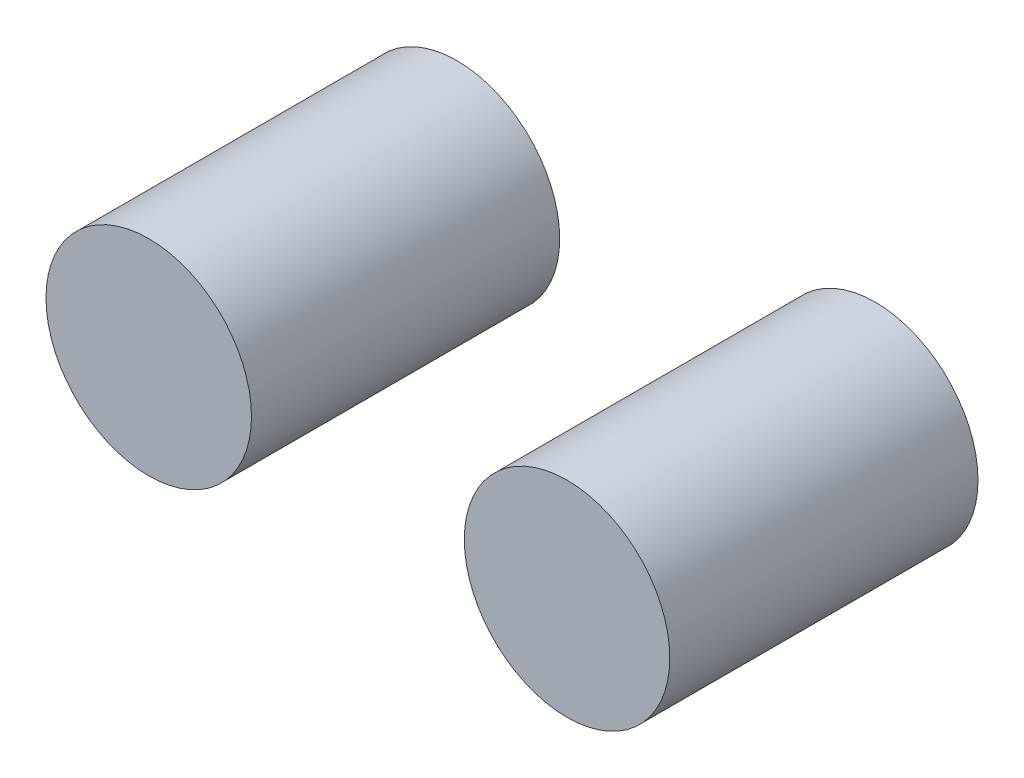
from build123d import *

# Parameters (mm, degrees)
ESBO_O2_R                  = 1
RESSALTO_EXTRUS_O2_DEPTH   = 3
RESSALTO_EXTRUS_O2_2_DEPTH = 3


with BuildPart() as part:
    # Esbo_o2 → Ressalto-extrus_o2 (new body)
    with BuildSketch(Plane.XY):
        with Locations((-6.862282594, 7.656909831)):
            Circle(ESBO_O2_R)
    extrude(amount=RESSALTO_EXTRUS_O2_DEPTH)


with BuildPart() as body_2:
    # Esbo_o2 → Ressalto-extrus_o2 2 (new body)
    with BuildSketch(Plane.XY):
        with Locations((-2.790775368, 7.656909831)):
            Circle(ESBO_O2_R)
    extrude(amount=RESSALTO_EXTRUS_O2_2_DEPTH)


solid = Compound([part.part, body_2.part])
